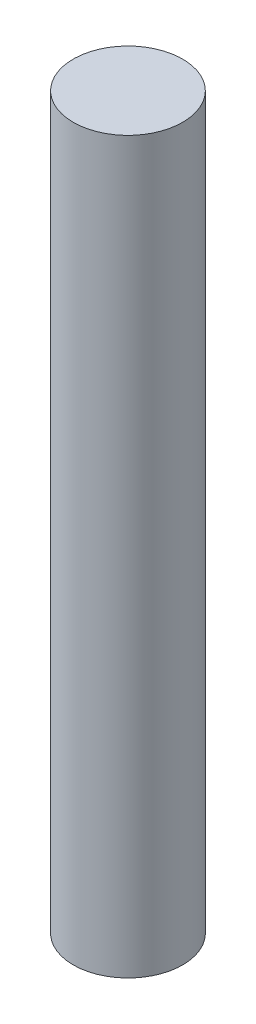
from build123d import *

# Parameters (mm, degrees)
SKETCH_1_R      = 1.5
EXTRUDE_1_DEPTH = 20


with BuildPart() as part:
    # Sketch 1 → Extrude 1 (new body)
    with BuildSketch(Plane(origin=(0, 0, 0), x_dir=(1, 0, 0), z_dir=(0, 1, 0))):
        with Locations(Location((-0.689358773, 0.406229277, 0), (0, 0, 270))):
            Circle(SKETCH_1_R)
    extrude(amount=EXTRUDE_1_DEPTH)


solid = part.part
